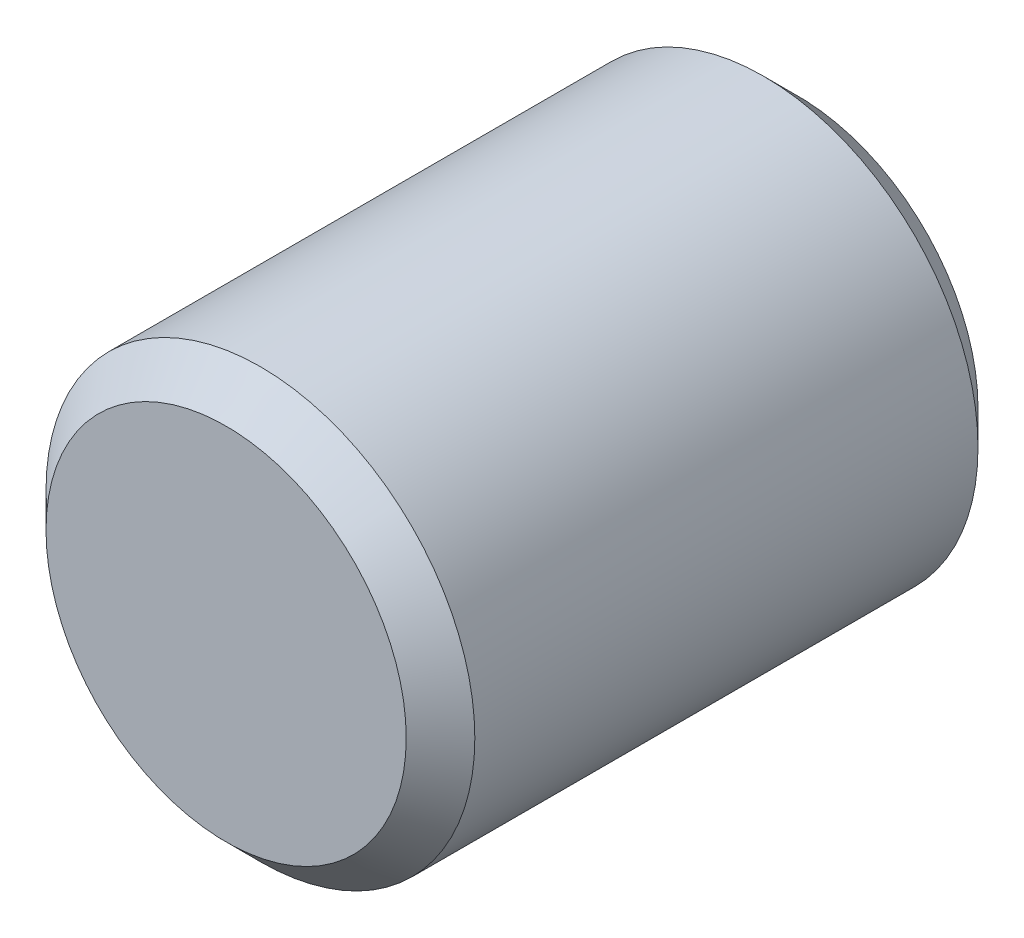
ISO-10303-21;
HEADER;
FILE_DESCRIPTION(('STEP AP214'),'2;1');
FILE_NAME('part.step','',(''),(''),'','','');
FILE_SCHEMA(('AUTOMOTIVE_DESIGN { 1 0 10303 214 1 1 1 1 }'));
ENDSEC;
DATA;
#1=APPLICATION_CONTEXT('core data for automotive mechanical design processes');
#2=APPLICATION_PROTOCOL_DEFINITION('international standard','automotive_design',2000,#1);
#3=PRODUCT_CONTEXT('',#1,'mechanical');
#4=PRODUCT('Part','Part','',(#3));
#5=PRODUCT_RELATED_PRODUCT_CATEGORY('part','',(#4));
#6=PRODUCT_DEFINITION_FORMATION('','',#4);
#7=PRODUCT_DEFINITION_CONTEXT('part definition',#1,'design');
#8=PRODUCT_DEFINITION('design','',#6,#7);
#9=PRODUCT_DEFINITION_SHAPE('','',#8);
#10=(LENGTH_UNIT() NAMED_UNIT(*) SI_UNIT(.MILLI.,.METRE.));
#11=(NAMED_UNIT(*) PLANE_ANGLE_UNIT() SI_UNIT($,.RADIAN.));
#12=(NAMED_UNIT(*) SI_UNIT($,.STERADIAN.) SOLID_ANGLE_UNIT());
#13=UNCERTAINTY_MEASURE_WITH_UNIT(LENGTH_MEASURE(1.E-05),#10,'distance_accuracy_value','');
#14=(GEOMETRIC_REPRESENTATION_CONTEXT(3) GLOBAL_UNCERTAINTY_ASSIGNED_CONTEXT((#13)) GLOBAL_UNIT_ASSIGNED_CONTEXT((#10,
#11,#12)) REPRESENTATION_CONTEXT('',''));
#15=CARTESIAN_POINT('',(0.,0.,0.));
#16=DIRECTION('',(0.,0.,1.));
#17=DIRECTION('',(1.,0.,0.));
#18=AXIS2_PLACEMENT_3D('',#15,#16,#17);
#19=CARTESIAN_POINT('',(0.,0.,3.175));
#20=DIRECTION('',(0.,0.,-1.));
#21=DIRECTION('',(-1.,0.,0.));
#22=AXIS2_PLACEMENT_3D('',#19,#20,#21);
#23=CYLINDRICAL_SURFACE('',#22,2.38125);
#24=CARTESIAN_POINT('',(0.,0.,-2.794));
#25=DIRECTION('',(0.,0.,1.));
#26=DIRECTION('',(1.,0.,0.));
#27=AXIS2_PLACEMENT_3D('',#24,#25,#26);
#28=CIRCLE('',#27,2.38125);
#29=CARTESIAN_POINT('',(2.38125,0.,-2.794));
#30=VERTEX_POINT('',#29);
#31=EDGE_CURVE('E39',#30,#30,#28,.T.);
#32=ORIENTED_EDGE('',*,*,#31,.T.);
#33=EDGE_LOOP('',(#32));
#34=FACE_BOUND('',#33,.T.);
#35=CARTESIAN_POINT('',(0.,0.,2.794));
#36=DIRECTION('',(0.,0.,1.));
#37=DIRECTION('',(1.,0.,0.));
#38=AXIS2_PLACEMENT_3D('',#35,#36,#37);
#39=CIRCLE('',#38,2.38125);
#40=CARTESIAN_POINT('',(2.38125,0.,2.794));
#41=VERTEX_POINT('',#40);
#42=EDGE_CURVE('E43',#41,#41,#39,.F.);
#43=ORIENTED_EDGE('',*,*,#42,.T.);
#44=EDGE_LOOP('',(#43));
#45=FACE_BOUND('',#44,.T.);
#46=ADVANCED_FACE('F29',(#34,#45),#23,.T.);
#47=CARTESIAN_POINT('',(0.,0.,3.175));
#48=DIRECTION('',(0.,0.,1.));
#49=DIRECTION('',(1.,0.,0.));
#50=AXIS2_PLACEMENT_3D('',#47,#48,#49);
#51=PLANE('',#50);
#52=CARTESIAN_POINT('',(0.,0.,3.175));
#53=DIRECTION('',(0.,0.,1.));
#54=DIRECTION('',(1.,0.,0.));
#55=AXIS2_PLACEMENT_3D('',#52,#53,#54);
#56=CIRCLE('',#55,2.00025);
#57=CARTESIAN_POINT('',(2.00025,0.,3.175));
#58=VERTEX_POINT('',#57);
#59=EDGE_CURVE('E10',#58,#58,#56,.T.);
#60=ORIENTED_EDGE('',*,*,#59,.T.);
#61=EDGE_LOOP('',(#60));
#62=FACE_BOUND('',#61,.T.);
#63=ADVANCED_FACE('F62',(#62),#51,.T.);
#64=CARTESIAN_POINT('',(0.,0.,-3.175));
#65=DIRECTION('',(0.,0.,1.));
#66=DIRECTION('',(1.,0.,0.));
#67=AXIS2_PLACEMENT_3D('',#64,#65,#66);
#68=PLANE('',#67);
#69=CARTESIAN_POINT('',(0.,0.,-3.175));
#70=DIRECTION('',(0.,0.,1.));
#71=DIRECTION('',(1.,0.,0.));
#72=AXIS2_PLACEMENT_3D('',#69,#70,#71);
#73=CIRCLE('',#72,2.00025);
#74=CARTESIAN_POINT('',(2.00025,0.,-3.175));
#75=VERTEX_POINT('',#74);
#76=EDGE_CURVE('E35',#75,#75,#73,.F.);
#77=ORIENTED_EDGE('',*,*,#76,.T.);
#78=EDGE_LOOP('',(#77));
#79=FACE_BOUND('',#78,.T.);
#80=ADVANCED_FACE('F58',(#79),#68,.F.);
#81=CARTESIAN_POINT('',(0.,0.,-2.794));
#82=DIRECTION('',(0.,0.,1.));
#83=DIRECTION('',(1.,0.,0.));
#84=AXIS2_PLACEMENT_3D('',#81,#82,#83);
#85=CONICAL_SURFACE('',#84,2.38125,0.785398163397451);
#86=CARTESIAN_POINT('',(2.00025,0.,-3.175));
#87=CARTESIAN_POINT('',(2.00421875,0.,-3.17103125));
#88=CARTESIAN_POINT('',(2.0081875,0.,-3.1670625));
#89=CARTESIAN_POINT('',(2.016125,0.,-3.159125));
#90=CARTESIAN_POINT('',(2.02009375,0.,-3.15515625));
#91=CARTESIAN_POINT('',(2.02803125,0.,-3.14721875));
#92=CARTESIAN_POINT('',(2.032,0.,-3.14325));
#93=CARTESIAN_POINT('',(2.0399375,0.,-3.1353125));
#94=CARTESIAN_POINT('',(2.04390625,0.,-3.13134375));
#95=CARTESIAN_POINT('',(2.05184375,0.,-3.12340625));
#96=CARTESIAN_POINT('',(2.0558125,0.,-3.1194375));
#97=CARTESIAN_POINT('',(2.06375,0.,-3.1115));
#98=CARTESIAN_POINT('',(2.06771875,0.,-3.10753125));
#99=CARTESIAN_POINT('',(2.07565625,0.,-3.09959375));
#100=CARTESIAN_POINT('',(2.079625,0.,-3.095625));
#101=CARTESIAN_POINT('',(2.0875625,0.,-3.0876875));
#102=CARTESIAN_POINT('',(2.09153125,0.,-3.08371875));
#103=CARTESIAN_POINT('',(2.09946875,0.,-3.07578125));
#104=CARTESIAN_POINT('',(2.1034375,0.,-3.0718125));
#105=CARTESIAN_POINT('',(2.111375,0.,-3.063875));
#106=CARTESIAN_POINT('',(2.11534375,0.,-3.05990625));
#107=CARTESIAN_POINT('',(2.12328125,0.,-3.05196875));
#108=CARTESIAN_POINT('',(2.12725,0.,-3.048));
#109=CARTESIAN_POINT('',(2.1351875,0.,-3.0400625));
#110=CARTESIAN_POINT('',(2.13915625,0.,-3.03609375));
#111=CARTESIAN_POINT('',(2.14709375,0.,-3.02815625));
#112=CARTESIAN_POINT('',(2.1510625,0.,-3.0241875));
#113=CARTESIAN_POINT('',(2.159,0.,-3.01625));
#114=CARTESIAN_POINT('',(2.16296875,0.,-3.01228125));
#115=CARTESIAN_POINT('',(2.17090625,0.,-3.00434375));
#116=CARTESIAN_POINT('',(2.174875,0.,-3.000375));
#117=CARTESIAN_POINT('',(2.1828125,0.,-2.9924375));
#118=CARTESIAN_POINT('',(2.18678125,0.,-2.98846875));
#119=CARTESIAN_POINT('',(2.19471875,0.,-2.98053125));
#120=CARTESIAN_POINT('',(2.1986875,0.,-2.9765625));
#121=CARTESIAN_POINT('',(2.206625,0.,-2.968625));
#122=CARTESIAN_POINT('',(2.21059375,0.,-2.96465625));
#123=CARTESIAN_POINT('',(2.21853125,0.,-2.95671875));
#124=CARTESIAN_POINT('',(2.2225,0.,-2.95275));
#125=CARTESIAN_POINT('',(2.2304375,0.,-2.9448125));
#126=CARTESIAN_POINT('',(2.23440625,0.,-2.94084375));
#127=CARTESIAN_POINT('',(2.24234375,0.,-2.93290625));
#128=CARTESIAN_POINT('',(2.2463125,0.,-2.9289375));
#129=CARTESIAN_POINT('',(2.25425,0.,-2.921));
#130=CARTESIAN_POINT('',(2.25821875,0.,-2.91703125));
#131=CARTESIAN_POINT('',(2.26615625,0.,-2.90909375));
#132=CARTESIAN_POINT('',(2.270125,0.,-2.905125));
#133=CARTESIAN_POINT('',(2.2780625,0.,-2.8971875));
#134=CARTESIAN_POINT('',(2.28203125,0.,-2.89321875));
#135=CARTESIAN_POINT('',(2.28996875,0.,-2.88528125));
#136=CARTESIAN_POINT('',(2.2939375,0.,-2.8813125));
#137=CARTESIAN_POINT('',(2.301875,0.,-2.873375));
#138=CARTESIAN_POINT('',(2.30584375,0.,-2.86940625));
#139=CARTESIAN_POINT('',(2.31378125,0.,-2.86146875));
#140=CARTESIAN_POINT('',(2.31775,0.,-2.8575));
#141=CARTESIAN_POINT('',(2.3256875,0.,-2.8495625));
#142=CARTESIAN_POINT('',(2.32965625,0.,-2.84559375));
#143=CARTESIAN_POINT('',(2.33759375,0.,-2.83765625));
#144=CARTESIAN_POINT('',(2.3415625,0.,-2.8336875));
#145=CARTESIAN_POINT('',(2.3495,0.,-2.82575));
#146=CARTESIAN_POINT('',(2.35346875,0.,-2.82178125));
#147=CARTESIAN_POINT('',(2.36140625,0.,-2.81384375));
#148=CARTESIAN_POINT('',(2.365375,0.,-2.809875));
#149=CARTESIAN_POINT('',(2.3733125,0.,-2.8019375));
#150=CARTESIAN_POINT('',(2.37728125,0.,-2.79796875));
#151=CARTESIAN_POINT('',(2.38125,0.,-2.794));
#152=B_SPLINE_CURVE_WITH_KNOTS('',3,(#86,#87,#88,#89,#90,#91,#92,#93,#94,#95,#96,#97,#98,#99,
#100,#101,#102,#103,#104,#105,#106,#107,#108,#109,#110,#111,#112,#113,#114,#115,#116,#117,#118,
#119,#120,#121,#122,#123,#124,#125,#126,#127,#128,#129,#130,#131,#132,#133,#134,#135,#136,#137,
#138,#139,#140,#141,#142,#143,#144,#145,#146,#147,#148,#149,#150,#151),.UNSPECIFIED.,.F.,.F.,(4,
2,2,2,2,2,2,2,2,2,2,2,2,2,2,2,2,2,2,2,2,2,2,2,2,2,2,2,2,2,2,2,4),(0.,0.0168379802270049,
0.0336759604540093,0.0505139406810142,0.0673519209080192,0.0841899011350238,0.101027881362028,
0.117865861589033,0.134703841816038,0.151541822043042,0.168379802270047,0.185217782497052,
0.202055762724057,0.218893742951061,0.235731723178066,0.252569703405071,0.269407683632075,
0.28624566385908,0.303083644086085,0.31992162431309,0.336759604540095,0.353597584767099,
0.370435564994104,0.387273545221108,0.404111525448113,0.420949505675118,0.437787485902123,
0.454625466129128,0.471463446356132,0.488301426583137,0.505139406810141,0.521977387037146,
0.538815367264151),.UNSPECIFIED.);
#153=EDGE_CURVE('BSEAM53',#75,#30,#152,.T.);
#154=ORIENTED_EDGE('',*,*,#76,.F.);
#155=ORIENTED_EDGE('',*,*,#31,.F.);
#156=ORIENTED_EDGE('',*,*,#153,.T.);
#157=ORIENTED_EDGE('',*,*,#153,.F.);
#158=EDGE_LOOP('',(#154,#156,#155,#157));
#159=FACE_BOUND('',#158,.T.);
#160=ADVANCED_FACE('F53',(#159),#85,.T.);
#161=CARTESIAN_POINT('',(0.,0.,3.175));
#162=DIRECTION('',(0.,0.,-1.));
#163=DIRECTION('',(-1.,0.,0.));
#164=AXIS2_PLACEMENT_3D('',#161,#162,#163);
#165=CONICAL_SURFACE('',#164,2.00025,0.785398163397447);
#166=ORIENTED_EDGE('',*,*,#42,.F.);
#167=EDGE_LOOP('',(#166));
#168=FACE_BOUND('',#167,.T.);
#169=ORIENTED_EDGE('',*,*,#59,.F.);
#170=EDGE_LOOP('',(#169));
#171=FACE_BOUND('',#170,.T.);
#172=ADVANCED_FACE('F50',(#168,#171),#165,.T.);
#173=CLOSED_SHELL('',(#46,#63,#80,#160,#172));
#174=MANIFOLD_SOLID_BREP('B2',#173);
#175=ADVANCED_BREP_SHAPE_REPRESENTATION('',(#18,#174),#14);
#176=SHAPE_DEFINITION_REPRESENTATION(#9,#175);
ENDSEC;
END-ISO-10303-21;
